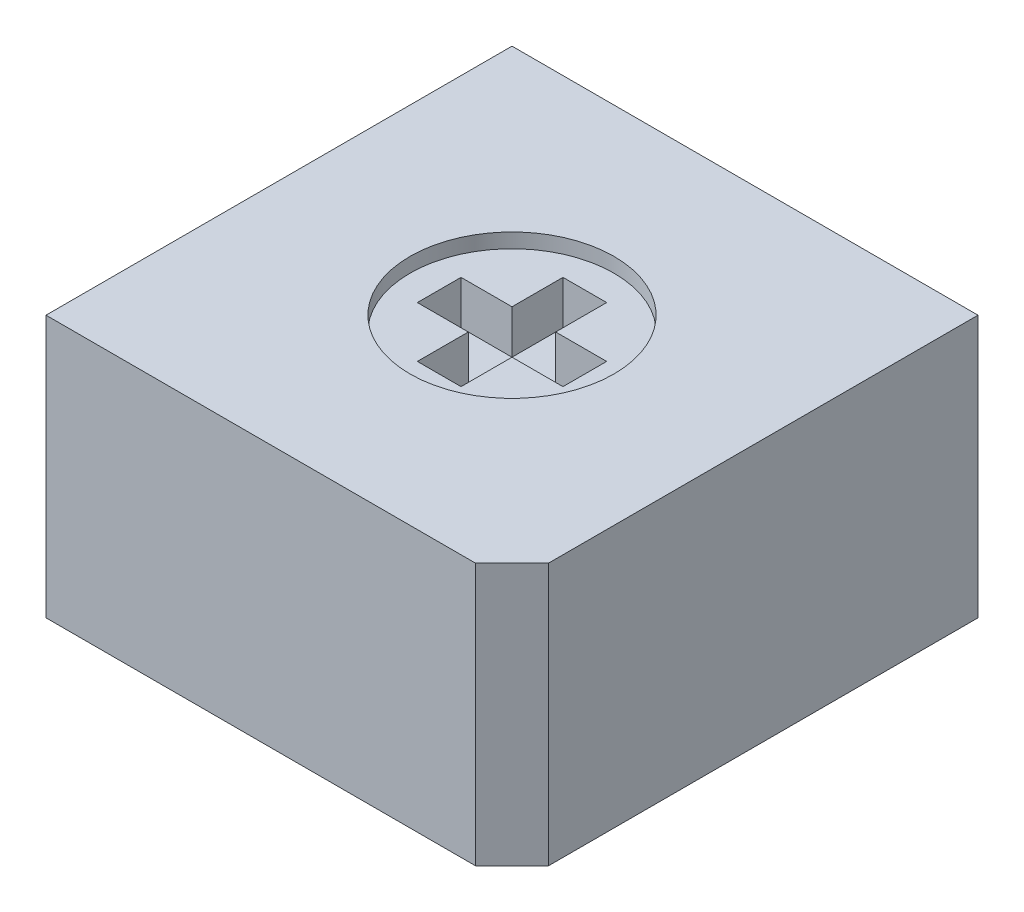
ISO-10303-21;
HEADER;
FILE_DESCRIPTION(('STEP AP214'),'2;1');
FILE_NAME('part.step','',(''),(''),'','','');
FILE_SCHEMA(('AUTOMOTIVE_DESIGN { 1 0 10303 214 1 1 1 1 }'));
ENDSEC;
DATA;
#1=APPLICATION_CONTEXT('core data for automotive mechanical design processes');
#2=APPLICATION_PROTOCOL_DEFINITION('international standard','automotive_design',2000,#1);
#3=PRODUCT_CONTEXT('',#1,'mechanical');
#4=PRODUCT('Part','Part','',(#3));
#5=PRODUCT_RELATED_PRODUCT_CATEGORY('part','',(#4));
#6=PRODUCT_DEFINITION_FORMATION('','',#4);
#7=PRODUCT_DEFINITION_CONTEXT('part definition',#1,'design');
#8=PRODUCT_DEFINITION('design','',#6,#7);
#9=PRODUCT_DEFINITION_SHAPE('','',#8);
#10=(LENGTH_UNIT() NAMED_UNIT(*) SI_UNIT(.MILLI.,.METRE.));
#11=(NAMED_UNIT(*) PLANE_ANGLE_UNIT() SI_UNIT($,.RADIAN.));
#12=(NAMED_UNIT(*) SI_UNIT($,.STERADIAN.) SOLID_ANGLE_UNIT());
#13=UNCERTAINTY_MEASURE_WITH_UNIT(LENGTH_MEASURE(1.E-05),#10,'distance_accuracy_value','');
#14=(GEOMETRIC_REPRESENTATION_CONTEXT(3) GLOBAL_UNCERTAINTY_ASSIGNED_CONTEXT((#13)) GLOBAL_UNIT_ASSIGNED_CONTEXT((#10,
#11,#12)) REPRESENTATION_CONTEXT('',''));
#15=CARTESIAN_POINT('',(0.,0.,0.));
#16=DIRECTION('',(0.,0.,1.));
#17=DIRECTION('',(1.,0.,0.));
#18=AXIS2_PLACEMENT_3D('',#15,#16,#17);
#19=CARTESIAN_POINT('',(27.9908,5.08,-13.2588));
#20=DIRECTION('',(0.,1.,0.));
#21=DIRECTION('',(-1.,0.,0.));
#22=AXIS2_PLACEMENT_3D('',#19,#20,#21);
#23=PLANE('',#22);
#24=DIRECTION('',(0.,0.,1.));
#25=VECTOR('',#24,1.);
#26=CARTESIAN_POINT('',(26.289,5.08,-11.1125));
#27=LINE('',#26,#25);
#28=CARTESIAN_POINT('',(26.289,5.08,-11.557));
#29=VERTEX_POINT('',#28);
#30=CARTESIAN_POINT('',(26.289,5.08,-10.668));
#31=VERTEX_POINT('',#30);
#32=EDGE_CURVE('E306',#29,#31,#27,.T.);
#33=ORIENTED_EDGE('',*,*,#32,.T.);
#34=DIRECTION('',(1.,0.,0.));
#35=VECTOR('',#34,1.);
#36=CARTESIAN_POINT('',(26.67,5.08,-10.668));
#37=LINE('',#36,#35);
#38=CARTESIAN_POINT('',(27.051,5.08,-10.668));
#39=VERTEX_POINT('',#38);
#40=EDGE_CURVE('E241',#31,#39,#37,.T.);
#41=ORIENTED_EDGE('',*,*,#40,.T.);
#42=DIRECTION('',(0.,0.,-1.));
#43=VECTOR('',#42,1.);
#44=CARTESIAN_POINT('',(27.051,5.08,-11.1125));
#45=LINE('',#44,#43);
#46=CARTESIAN_POINT('',(27.051,5.08,-11.557));
#47=VERTEX_POINT('',#46);
#48=EDGE_CURVE('E250',#39,#47,#45,.T.);
#49=ORIENTED_EDGE('',*,*,#48,.T.);
#50=DIRECTION('',(1.,0.,0.));
#51=VECTOR('',#50,1.);
#52=CARTESIAN_POINT('',(27.4955,5.08,-11.557));
#53=LINE('',#52,#51);
#54=CARTESIAN_POINT('',(27.94,5.08,-11.557));
#55=VERTEX_POINT('',#54);
#56=EDGE_CURVE('E256',#47,#55,#53,.T.);
#57=ORIENTED_EDGE('',*,*,#56,.T.);
#58=DIRECTION('',(0.,0.,-1.));
#59=VECTOR('',#58,1.);
#60=CARTESIAN_POINT('',(27.94,5.08,-11.938));
#61=LINE('',#60,#59);
#62=CARTESIAN_POINT('',(27.94,5.08,-12.319));
#63=VERTEX_POINT('',#62);
#64=EDGE_CURVE('E262',#55,#63,#61,.T.);
#65=ORIENTED_EDGE('',*,*,#64,.T.);
#66=DIRECTION('',(-1.,0.,0.));
#67=VECTOR('',#66,1.);
#68=CARTESIAN_POINT('',(27.4955,5.08,-12.319));
#69=LINE('',#68,#67);
#70=CARTESIAN_POINT('',(27.051,5.08,-12.319));
#71=VERTEX_POINT('',#70);
#72=EDGE_CURVE('E268',#63,#71,#69,.T.);
#73=ORIENTED_EDGE('',*,*,#72,.T.);
#74=DIRECTION('',(0.,0.,-1.));
#75=VECTOR('',#74,1.);
#76=CARTESIAN_POINT('',(27.051,5.08,-12.7635));
#77=LINE('',#76,#75);
#78=CARTESIAN_POINT('',(27.051,5.08,-13.208));
#79=VERTEX_POINT('',#78);
#80=EDGE_CURVE('E274',#71,#79,#77,.T.);
#81=ORIENTED_EDGE('',*,*,#80,.T.);
#82=DIRECTION('',(-1.,0.,0.));
#83=VECTOR('',#82,1.);
#84=CARTESIAN_POINT('',(26.67,5.08,-13.208));
#85=LINE('',#84,#83);
#86=CARTESIAN_POINT('',(26.289,5.08,-13.208));
#87=VERTEX_POINT('',#86);
#88=EDGE_CURVE('E280',#79,#87,#85,.T.);
#89=ORIENTED_EDGE('',*,*,#88,.T.);
#90=DIRECTION('',(0.,0.,1.));
#91=VECTOR('',#90,1.);
#92=CARTESIAN_POINT('',(26.289,5.08,-12.7635));
#93=LINE('',#92,#91);
#94=CARTESIAN_POINT('',(26.289,5.08,-12.319));
#95=VERTEX_POINT('',#94);
#96=EDGE_CURVE('E286',#87,#95,#93,.T.);
#97=ORIENTED_EDGE('',*,*,#96,.T.);
#98=DIRECTION('',(-1.,0.,0.));
#99=VECTOR('',#98,1.);
#100=CARTESIAN_POINT('',(25.8445,5.08,-12.319));
#101=LINE('',#100,#99);
#102=CARTESIAN_POINT('',(25.4,5.08,-12.319));
#103=VERTEX_POINT('',#102);
#104=EDGE_CURVE('E292',#95,#103,#101,.T.);
#105=ORIENTED_EDGE('',*,*,#104,.T.);
#106=DIRECTION('',(0.,0.,1.));
#107=VECTOR('',#106,1.);
#108=CARTESIAN_POINT('',(25.4,5.08,-11.938));
#109=LINE('',#108,#107);
#110=CARTESIAN_POINT('',(25.4,5.08,-11.557));
#111=VERTEX_POINT('',#110);
#112=EDGE_CURVE('E298',#103,#111,#109,.T.);
#113=ORIENTED_EDGE('',*,*,#112,.T.);
#114=DIRECTION('',(1.,0.,0.));
#115=VECTOR('',#114,1.);
#116=CARTESIAN_POINT('',(25.8445,5.08,-11.557));
#117=LINE('',#116,#115);
#118=EDGE_CURVE('E304',#111,#29,#117,.T.);
#119=ORIENTED_EDGE('',*,*,#118,.T.);
#120=EDGE_LOOP('',(#33,#41,#49,#57,#65,#73,#81,#89,#97,#105,#113,#119));
#121=FACE_BOUND('',#120,.T.);
#122=ADVANCED_FACE('F17',(#121),#23,.T.);
#123=CARTESIAN_POINT('',(26.289,5.06476,-11.57478));
#124=DIRECTION('',(-1.,0.,0.));
#125=DIRECTION('',(0.,0.,1.));
#126=AXIS2_PLACEMENT_3D('',#123,#124,#125);
#127=PLANE('',#126);
#128=ORIENTED_EDGE('',*,*,#32,.F.);
#129=DIRECTION('',(0.,1.,0.));
#130=VECTOR('',#129,1.);
#131=CARTESIAN_POINT('',(26.289,5.461,-11.557));
#132=LINE('',#131,#130);
#133=CARTESIAN_POINT('',(26.289,5.842,-11.557));
#134=VERTEX_POINT('',#133);
#135=EDGE_CURVE('E301',#29,#134,#132,.T.);
#136=ORIENTED_EDGE('',*,*,#135,.T.);
#137=DIRECTION('',(0.,0.,-1.));
#138=VECTOR('',#137,1.);
#139=CARTESIAN_POINT('',(26.289,5.842,-11.938));
#140=LINE('',#139,#138);
#141=CARTESIAN_POINT('',(26.289,5.842,-10.668));
#142=VERTEX_POINT('',#141);
#143=EDGE_CURVE('E236',#142,#134,#140,.T.);
#144=ORIENTED_EDGE('',*,*,#143,.F.);
#145=DIRECTION('',(0.,-1.,0.));
#146=VECTOR('',#145,1.);
#147=CARTESIAN_POINT('',(26.289,5.461,-10.668));
#148=LINE('',#147,#146);
#149=EDGE_CURVE('E244',#142,#31,#148,.T.);
#150=ORIENTED_EDGE('',*,*,#149,.T.);
#151=EDGE_LOOP('',(#128,#136,#144,#150));
#152=FACE_BOUND('',#151,.T.);
#153=ADVANCED_FACE('F315',(#152),#127,.F.);
#154=CARTESIAN_POINT('',(25.38222,5.06476,-11.557));
#155=DIRECTION('',(0.,0.,1.));
#156=DIRECTION('',(1.,0.,0.));
#157=AXIS2_PLACEMENT_3D('',#154,#155,#156);
#158=PLANE('',#157);
#159=ORIENTED_EDGE('',*,*,#118,.F.);
#160=DIRECTION('',(0.,1.,0.));
#161=VECTOR('',#160,1.);
#162=CARTESIAN_POINT('',(25.4,5.461,-11.557));
#163=LINE('',#162,#161);
#164=CARTESIAN_POINT('',(25.4,5.842,-11.557));
#165=VERTEX_POINT('',#164);
#166=EDGE_CURVE('E295',#111,#165,#163,.T.);
#167=ORIENTED_EDGE('',*,*,#166,.T.);
#168=DIRECTION('',(-1.,0.,0.));
#169=VECTOR('',#168,1.);
#170=CARTESIAN_POINT('',(26.67,5.842,-11.557));
#171=LINE('',#170,#169);
#172=EDGE_CURVE('E234',#134,#165,#171,.T.);
#173=ORIENTED_EDGE('',*,*,#172,.F.);
#174=ORIENTED_EDGE('',*,*,#135,.F.);
#175=EDGE_LOOP('',(#159,#167,#173,#174));
#176=FACE_BOUND('',#175,.T.);
#177=ADVANCED_FACE('F355',(#176),#158,.F.);
#178=CARTESIAN_POINT('',(25.4,5.06476,-12.33424));
#179=DIRECTION('',(-1.,0.,0.));
#180=DIRECTION('',(0.,0.,1.));
#181=AXIS2_PLACEMENT_3D('',#178,#179,#180);
#182=PLANE('',#181);
#183=ORIENTED_EDGE('',*,*,#112,.F.);
#184=DIRECTION('',(0.,1.,0.));
#185=VECTOR('',#184,1.);
#186=CARTESIAN_POINT('',(25.4,5.461,-12.319));
#187=LINE('',#186,#185);
#188=CARTESIAN_POINT('',(25.4,5.842,-12.319));
#189=VERTEX_POINT('',#188);
#190=EDGE_CURVE('E289',#103,#189,#187,.T.);
#191=ORIENTED_EDGE('',*,*,#190,.T.);
#192=DIRECTION('',(0.,0.,-1.));
#193=VECTOR('',#192,1.);
#194=CARTESIAN_POINT('',(25.4,5.842,-11.938));
#195=LINE('',#194,#193);
#196=EDGE_CURVE('E232',#165,#189,#195,.T.);
#197=ORIENTED_EDGE('',*,*,#196,.F.);
#198=ORIENTED_EDGE('',*,*,#166,.F.);
#199=EDGE_LOOP('',(#183,#191,#197,#198));
#200=FACE_BOUND('',#199,.T.);
#201=ADVANCED_FACE('F352',(#200),#182,.F.);
#202=CARTESIAN_POINT('',(26.30678,5.06476,-12.319));
#203=DIRECTION('',(0.,0.,-1.));
#204=DIRECTION('',(-1.,0.,0.));
#205=AXIS2_PLACEMENT_3D('',#202,#203,#204);
#206=PLANE('',#205);
#207=ORIENTED_EDGE('',*,*,#104,.F.);
#208=DIRECTION('',(0.,1.,0.));
#209=VECTOR('',#208,1.);
#210=CARTESIAN_POINT('',(26.289,5.461,-12.319));
#211=LINE('',#210,#209);
#212=CARTESIAN_POINT('',(26.289,5.842,-12.319));
#213=VERTEX_POINT('',#212);
#214=EDGE_CURVE('E283',#95,#213,#211,.T.);
#215=ORIENTED_EDGE('',*,*,#214,.T.);
#216=DIRECTION('',(1.,0.,0.));
#217=VECTOR('',#216,1.);
#218=CARTESIAN_POINT('',(26.67,5.842,-12.319));
#219=LINE('',#218,#217);
#220=EDGE_CURVE('E230',#189,#213,#219,.T.);
#221=ORIENTED_EDGE('',*,*,#220,.F.);
#222=ORIENTED_EDGE('',*,*,#190,.F.);
#223=EDGE_LOOP('',(#207,#215,#221,#222));
#224=FACE_BOUND('',#223,.T.);
#225=ADVANCED_FACE('F348',(#224),#206,.F.);
#226=CARTESIAN_POINT('',(26.289,5.06476,-13.22578));
#227=DIRECTION('',(-1.,0.,0.));
#228=DIRECTION('',(0.,0.,1.));
#229=AXIS2_PLACEMENT_3D('',#226,#227,#228);
#230=PLANE('',#229);
#231=ORIENTED_EDGE('',*,*,#96,.F.);
#232=DIRECTION('',(0.,1.,0.));
#233=VECTOR('',#232,1.);
#234=CARTESIAN_POINT('',(26.289,5.461,-13.208));
#235=LINE('',#234,#233);
#236=CARTESIAN_POINT('',(26.289,5.842,-13.208));
#237=VERTEX_POINT('',#236);
#238=EDGE_CURVE('E277',#87,#237,#235,.T.);
#239=ORIENTED_EDGE('',*,*,#238,.T.);
#240=DIRECTION('',(0.,0.,-1.));
#241=VECTOR('',#240,1.);
#242=CARTESIAN_POINT('',(26.289,5.842,-11.938));
#243=LINE('',#242,#241);
#244=EDGE_CURVE('E228',#213,#237,#243,.T.);
#245=ORIENTED_EDGE('',*,*,#244,.F.);
#246=ORIENTED_EDGE('',*,*,#214,.F.);
#247=EDGE_LOOP('',(#231,#239,#245,#246));
#248=FACE_BOUND('',#247,.T.);
#249=ADVANCED_FACE('F344',(#248),#230,.F.);
#250=CARTESIAN_POINT('',(27.06624,5.06476,-13.208));
#251=DIRECTION('',(0.,0.,-1.));
#252=DIRECTION('',(-1.,0.,0.));
#253=AXIS2_PLACEMENT_3D('',#250,#251,#252);
#254=PLANE('',#253);
#255=ORIENTED_EDGE('',*,*,#88,.F.);
#256=DIRECTION('',(0.,1.,0.));
#257=VECTOR('',#256,1.);
#258=CARTESIAN_POINT('',(27.051,5.461,-13.208));
#259=LINE('',#258,#257);
#260=CARTESIAN_POINT('',(27.051,5.842,-13.208));
#261=VERTEX_POINT('',#260);
#262=EDGE_CURVE('E271',#79,#261,#259,.T.);
#263=ORIENTED_EDGE('',*,*,#262,.T.);
#264=DIRECTION('',(1.,0.,0.));
#265=VECTOR('',#264,1.);
#266=CARTESIAN_POINT('',(26.67,5.842,-13.208));
#267=LINE('',#266,#265);
#268=EDGE_CURVE('E226',#237,#261,#267,.T.);
#269=ORIENTED_EDGE('',*,*,#268,.F.);
#270=ORIENTED_EDGE('',*,*,#238,.F.);
#271=EDGE_LOOP('',(#255,#263,#269,#270));
#272=FACE_BOUND('',#271,.T.);
#273=ADVANCED_FACE('F340',(#272),#254,.F.);
#274=CARTESIAN_POINT('',(27.051,5.06476,-12.30122));
#275=DIRECTION('',(1.,0.,0.));
#276=DIRECTION('',(0.,0.,-1.));
#277=AXIS2_PLACEMENT_3D('',#274,#275,#276);
#278=PLANE('',#277);
#279=ORIENTED_EDGE('',*,*,#80,.F.);
#280=DIRECTION('',(0.,1.,0.));
#281=VECTOR('',#280,1.);
#282=CARTESIAN_POINT('',(27.051,5.461,-12.319));
#283=LINE('',#282,#281);
#284=CARTESIAN_POINT('',(27.051,5.842,-12.319));
#285=VERTEX_POINT('',#284);
#286=EDGE_CURVE('E265',#71,#285,#283,.T.);
#287=ORIENTED_EDGE('',*,*,#286,.T.);
#288=DIRECTION('',(0.,0.,1.));
#289=VECTOR('',#288,1.);
#290=CARTESIAN_POINT('',(27.051,5.842,-11.938));
#291=LINE('',#290,#289);
#292=EDGE_CURVE('E224',#261,#285,#291,.T.);
#293=ORIENTED_EDGE('',*,*,#292,.F.);
#294=ORIENTED_EDGE('',*,*,#262,.F.);
#295=EDGE_LOOP('',(#279,#287,#293,#294));
#296=FACE_BOUND('',#295,.T.);
#297=ADVANCED_FACE('F336',(#296),#278,.F.);
#298=CARTESIAN_POINT('',(27.95778,5.06476,-12.319));
#299=DIRECTION('',(0.,0.,-1.));
#300=DIRECTION('',(-1.,0.,0.));
#301=AXIS2_PLACEMENT_3D('',#298,#299,#300);
#302=PLANE('',#301);
#303=ORIENTED_EDGE('',*,*,#72,.F.);
#304=DIRECTION('',(0.,1.,0.));
#305=VECTOR('',#304,1.);
#306=CARTESIAN_POINT('',(27.94,5.461,-12.319));
#307=LINE('',#306,#305);
#308=CARTESIAN_POINT('',(27.94,5.842,-12.319));
#309=VERTEX_POINT('',#308);
#310=EDGE_CURVE('E259',#63,#309,#307,.T.);
#311=ORIENTED_EDGE('',*,*,#310,.T.);
#312=DIRECTION('',(1.,0.,0.));
#313=VECTOR('',#312,1.);
#314=CARTESIAN_POINT('',(26.67,5.842,-12.319));
#315=LINE('',#314,#313);
#316=EDGE_CURVE('E222',#285,#309,#315,.T.);
#317=ORIENTED_EDGE('',*,*,#316,.F.);
#318=ORIENTED_EDGE('',*,*,#286,.F.);
#319=EDGE_LOOP('',(#303,#311,#317,#318));
#320=FACE_BOUND('',#319,.T.);
#321=ADVANCED_FACE('F332',(#320),#302,.F.);
#322=CARTESIAN_POINT('',(27.94,5.06476,-11.54176));
#323=DIRECTION('',(1.,0.,0.));
#324=DIRECTION('',(0.,0.,-1.));
#325=AXIS2_PLACEMENT_3D('',#322,#323,#324);
#326=PLANE('',#325);
#327=ORIENTED_EDGE('',*,*,#64,.F.);
#328=DIRECTION('',(0.,1.,0.));
#329=VECTOR('',#328,1.);
#330=CARTESIAN_POINT('',(27.94,5.461,-11.557));
#331=LINE('',#330,#329);
#332=CARTESIAN_POINT('',(27.94,5.842,-11.557));
#333=VERTEX_POINT('',#332);
#334=EDGE_CURVE('E253',#55,#333,#331,.T.);
#335=ORIENTED_EDGE('',*,*,#334,.T.);
#336=DIRECTION('',(0.,0.,1.));
#337=VECTOR('',#336,1.);
#338=CARTESIAN_POINT('',(27.94,5.842,-11.938));
#339=LINE('',#338,#337);
#340=EDGE_CURVE('E220',#309,#333,#339,.T.);
#341=ORIENTED_EDGE('',*,*,#340,.F.);
#342=ORIENTED_EDGE('',*,*,#310,.F.);
#343=EDGE_LOOP('',(#327,#335,#341,#342));
#344=FACE_BOUND('',#343,.T.);
#345=ADVANCED_FACE('F328',(#344),#326,.F.);
#346=CARTESIAN_POINT('',(27.03322,5.06476,-11.557));
#347=DIRECTION('',(0.,0.,1.));
#348=DIRECTION('',(1.,0.,0.));
#349=AXIS2_PLACEMENT_3D('',#346,#347,#348);
#350=PLANE('',#349);
#351=ORIENTED_EDGE('',*,*,#56,.F.);
#352=DIRECTION('',(0.,1.,0.));
#353=VECTOR('',#352,1.);
#354=CARTESIAN_POINT('',(27.051,5.461,-11.557));
#355=LINE('',#354,#353);
#356=CARTESIAN_POINT('',(27.051,5.842,-11.557));
#357=VERTEX_POINT('',#356);
#358=EDGE_CURVE('E247',#47,#357,#355,.T.);
#359=ORIENTED_EDGE('',*,*,#358,.T.);
#360=DIRECTION('',(-1.,0.,0.));
#361=VECTOR('',#360,1.);
#362=CARTESIAN_POINT('',(26.67,5.842,-11.557));
#363=LINE('',#362,#361);
#364=EDGE_CURVE('E218',#333,#357,#363,.T.);
#365=ORIENTED_EDGE('',*,*,#364,.F.);
#366=ORIENTED_EDGE('',*,*,#334,.F.);
#367=EDGE_LOOP('',(#351,#359,#365,#366));
#368=FACE_BOUND('',#367,.T.);
#369=ADVANCED_FACE('F325',(#368),#350,.F.);
#370=CARTESIAN_POINT('',(27.051,5.06476,-10.65022));
#371=DIRECTION('',(1.,0.,0.));
#372=DIRECTION('',(0.,0.,-1.));
#373=AXIS2_PLACEMENT_3D('',#370,#371,#372);
#374=PLANE('',#373);
#375=ORIENTED_EDGE('',*,*,#48,.F.);
#376=DIRECTION('',(0.,1.,0.));
#377=VECTOR('',#376,1.);
#378=CARTESIAN_POINT('',(27.051,5.461,-10.668));
#379=LINE('',#378,#377);
#380=CARTESIAN_POINT('',(27.051,5.842,-10.668));
#381=VERTEX_POINT('',#380);
#382=EDGE_CURVE('E238',#39,#381,#379,.T.);
#383=ORIENTED_EDGE('',*,*,#382,.T.);
#384=DIRECTION('',(0.,0.,1.));
#385=VECTOR('',#384,1.);
#386=CARTESIAN_POINT('',(27.051,5.842,-11.938));
#387=LINE('',#386,#385);
#388=EDGE_CURVE('E216',#357,#381,#387,.T.);
#389=ORIENTED_EDGE('',*,*,#388,.F.);
#390=ORIENTED_EDGE('',*,*,#358,.F.);
#391=EDGE_LOOP('',(#375,#383,#389,#390));
#392=FACE_BOUND('',#391,.T.);
#393=ADVANCED_FACE('F322',(#392),#374,.F.);
#394=CARTESIAN_POINT('',(26.27376,5.06476,-10.668));
#395=DIRECTION('',(0.,0.,1.));
#396=DIRECTION('',(1.,0.,0.));
#397=AXIS2_PLACEMENT_3D('',#394,#395,#396);
#398=PLANE('',#397);
#399=ORIENTED_EDGE('',*,*,#40,.F.);
#400=ORIENTED_EDGE('',*,*,#149,.F.);
#401=DIRECTION('',(-1.,0.,0.));
#402=VECTOR('',#401,1.);
#403=CARTESIAN_POINT('',(26.67,5.842,-10.668));
#404=LINE('',#403,#402);
#405=EDGE_CURVE('E213',#381,#142,#404,.T.);
#406=ORIENTED_EDGE('',*,*,#405,.F.);
#407=ORIENTED_EDGE('',*,*,#382,.F.);
#408=EDGE_LOOP('',(#399,#400,#406,#407));
#409=FACE_BOUND('',#408,.T.);
#410=ADVANCED_FACE('F179',(#409),#398,.F.);
#411=CARTESIAN_POINT('',(28.51912,5.842,-13.78712));
#412=DIRECTION('',(0.,1.,0.));
#413=DIRECTION('',(-1.,0.,0.));
#414=AXIS2_PLACEMENT_3D('',#411,#412,#413);
#415=PLANE('',#414);
#416=ORIENTED_EDGE('',*,*,#388,.T.);
#417=ORIENTED_EDGE('',*,*,#405,.T.);
#418=ORIENTED_EDGE('',*,*,#143,.T.);
#419=ORIENTED_EDGE('',*,*,#172,.T.);
#420=ORIENTED_EDGE('',*,*,#196,.T.);
#421=ORIENTED_EDGE('',*,*,#220,.T.);
#422=ORIENTED_EDGE('',*,*,#244,.T.);
#423=ORIENTED_EDGE('',*,*,#268,.T.);
#424=ORIENTED_EDGE('',*,*,#292,.T.);
#425=ORIENTED_EDGE('',*,*,#316,.T.);
#426=ORIENTED_EDGE('',*,*,#340,.T.);
#427=ORIENTED_EDGE('',*,*,#364,.T.);
#428=EDGE_LOOP('',(#416,#417,#418,#419,#420,#421,#422,#423,#424,#425,#426,#427));
#429=FACE_BOUND('',#428,.T.);
#430=CARTESIAN_POINT('',(26.67,5.84199999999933,-11.938));
#431=DIRECTION('',(0.,1.,0.));
#432=DIRECTION('',(0.,0.,1.));
#433=AXIS2_PLACEMENT_3D('',#430,#431,#432);
#434=CIRCLE('',#433,1.778);
#435=CARTESIAN_POINT('',(26.67,5.84199999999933,-10.16));
#436=VERTEX_POINT('',#435);
#437=EDGE_CURVE('E21',#436,#436,#434,.F.);
#438=ORIENTED_EDGE('',*,*,#437,.F.);
#439=EDGE_LOOP('',(#438));
#440=FACE_BOUND('',#439,.T.);
#441=ADVANCED_FACE('F169',(#429,#440),#415,.T.);
#442=CARTESIAN_POINT('',(26.67,5.84199999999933,-11.938));
#443=DIRECTION('',(0.,1.,0.));
#444=DIRECTION('',(0.,0.,1.));
#445=AXIS2_PLACEMENT_3D('',#442,#443,#444);
#446=CYLINDRICAL_SURFACE('',#445,1.778);
#447=ORIENTED_EDGE('',*,*,#437,.T.);
#448=EDGE_LOOP('',(#447));
#449=FACE_BOUND('',#448,.T.);
#450=CARTESIAN_POINT('',(26.67,6.09600000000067,-11.938));
#451=DIRECTION('',(0.,1.,0.));
#452=DIRECTION('',(0.,0.,1.));
#453=AXIS2_PLACEMENT_3D('',#450,#451,#452);
#454=CIRCLE('',#453,1.778);
#455=CARTESIAN_POINT('',(26.67,6.09600000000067,-10.16));
#456=VERTEX_POINT('',#455);
#457=EDGE_CURVE('E149',#456,#456,#454,.F.);
#458=ORIENTED_EDGE('',*,*,#457,.F.);
#459=EDGE_LOOP('',(#458));
#460=FACE_BOUND('',#459,.T.);
#461=ADVANCED_FACE('F167',(#449,#460),#446,.F.);
#462=CARTESIAN_POINT('',(30.7467,6.18744,-8.5217));
#463=DIRECTION('',(0.70710678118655,0.,0.707106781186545));
#464=DIRECTION('',(-0.707106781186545,0.,0.70710678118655));
#465=AXIS2_PLACEMENT_3D('',#462,#463,#464);
#466=PLANE('',#465);
#467=DIRECTION('',(0.707106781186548,0.,-0.707106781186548));
#468=VECTOR('',#467,1.);
#469=CARTESIAN_POINT('',(30.099,6.096,-7.874));
#470=LINE('',#469,#468);
#471=CARTESIAN_POINT('',(30.099,6.096,-7.874));
#472=VERTEX_POINT('',#471);
#473=CARTESIAN_POINT('',(30.734,6.096,-8.509));
#474=VERTEX_POINT('',#473);
#475=EDGE_CURVE('E142',#472,#474,#470,.T.);
#476=ORIENTED_EDGE('',*,*,#475,.F.);
#477=DIRECTION('',(0.,1.,0.));
#478=VECTOR('',#477,1.);
#479=CARTESIAN_POINT('',(30.099,3.81,-7.874));
#480=LINE('',#479,#478);
#481=CARTESIAN_POINT('',(30.099,1.524,-7.87400000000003));
#482=VERTEX_POINT('',#481);
#483=EDGE_CURVE('E131',#482,#472,#480,.T.);
#484=ORIENTED_EDGE('',*,*,#483,.F.);
#485=DIRECTION('',(0.707106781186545,0.,-0.70710678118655));
#486=VECTOR('',#485,1.);
#487=CARTESIAN_POINT('',(30.4165,1.524,-8.1915));
#488=LINE('',#487,#486);
#489=CARTESIAN_POINT('',(30.734,1.524,-8.50899999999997));
#490=VERTEX_POINT('',#489);
#491=EDGE_CURVE('E150',#482,#490,#488,.T.);
#492=ORIENTED_EDGE('',*,*,#491,.T.);
#493=DIRECTION('',(0.,-1.,0.));
#494=VECTOR('',#493,1.);
#495=CARTESIAN_POINT('',(30.734,3.81,-8.509));
#496=LINE('',#495,#494);
#497=EDGE_CURVE('E145',#474,#490,#496,.T.);
#498=ORIENTED_EDGE('',*,*,#497,.F.);
#499=EDGE_LOOP('',(#476,#484,#492,#498));
#500=FACE_BOUND('',#499,.T.);
#501=ADVANCED_FACE('F143',(#500),#466,.T.);
#502=CARTESIAN_POINT('',(30.89656,6.096,-16.16456));
#503=DIRECTION('',(0.,1.,0.));
#504=DIRECTION('',(-1.,0.,0.));
#505=AXIS2_PLACEMENT_3D('',#502,#503,#504);
#506=PLANE('',#505);
#507=ORIENTED_EDGE('',*,*,#457,.T.);
#508=EDGE_LOOP('',(#507));
#509=FACE_BOUND('',#508,.T.);
#510=DIRECTION('',(0.,0.,-1.));
#511=VECTOR('',#510,1.);
#512=CARTESIAN_POINT('',(22.606,6.096,-11.938));
#513=LINE('',#512,#511);
#514=CARTESIAN_POINT('',(22.606,6.096,-7.874));
#515=VERTEX_POINT('',#514);
#516=CARTESIAN_POINT('',(22.606,6.096,-16.002));
#517=VERTEX_POINT('',#516);
#518=EDGE_CURVE('E153',#515,#517,#513,.T.);
#519=ORIENTED_EDGE('',*,*,#518,.F.);
#520=DIRECTION('',(-1.,0.,0.));
#521=VECTOR('',#520,1.);
#522=CARTESIAN_POINT('',(26.3525,6.096,-7.874));
#523=LINE('',#522,#521);
#524=EDGE_CURVE('E135',#472,#515,#523,.T.);
#525=ORIENTED_EDGE('',*,*,#524,.F.);
#526=ORIENTED_EDGE('',*,*,#475,.T.);
#527=DIRECTION('',(0.,0.,1.));
#528=VECTOR('',#527,1.);
#529=CARTESIAN_POINT('',(30.734,6.096,-12.2555));
#530=LINE('',#529,#528);
#531=CARTESIAN_POINT('',(30.734,6.096,-16.002));
#532=VERTEX_POINT('',#531);
#533=EDGE_CURVE('E159',#532,#474,#530,.T.);
#534=ORIENTED_EDGE('',*,*,#533,.F.);
#535=DIRECTION('',(1.,0.,0.));
#536=VECTOR('',#535,1.);
#537=CARTESIAN_POINT('',(26.67,6.096,-16.002));
#538=LINE('',#537,#536);
#539=EDGE_CURVE('E161',#517,#532,#538,.T.);
#540=ORIENTED_EDGE('',*,*,#539,.F.);
#541=EDGE_LOOP('',(#519,#525,#526,#534,#540));
#542=FACE_BOUND('',#541,.T.);
#543=ADVANCED_FACE('F151',(#509,#542),#506,.T.);
#544=CARTESIAN_POINT('',(30.734,1.43256,-8.35914));
#545=DIRECTION('',(1.,0.,0.));
#546=DIRECTION('',(0.,0.,-1.));
#547=AXIS2_PLACEMENT_3D('',#544,#545,#546);
#548=PLANE('',#547);
#549=DIRECTION('',(0.,-1.,0.));
#550=VECTOR('',#549,1.);
#551=CARTESIAN_POINT('',(30.734,3.81,-16.002));
#552=LINE('',#551,#550);
#553=CARTESIAN_POINT('',(30.734,1.524,-16.002));
#554=VERTEX_POINT('',#553);
#555=EDGE_CURVE('E204',#532,#554,#552,.T.);
#556=ORIENTED_EDGE('',*,*,#555,.F.);
#557=ORIENTED_EDGE('',*,*,#533,.T.);
#558=ORIENTED_EDGE('',*,*,#497,.T.);
#559=DIRECTION('',(0.,0.,-1.));
#560=VECTOR('',#559,1.);
#561=CARTESIAN_POINT('',(30.734,1.524,-11.938));
#562=LINE('',#561,#560);
#563=EDGE_CURVE('E155',#490,#554,#562,.T.);
#564=ORIENTED_EDGE('',*,*,#563,.T.);
#565=EDGE_LOOP('',(#556,#557,#558,#564));
#566=FACE_BOUND('',#565,.T.);
#567=ADVANCED_FACE('F385',(#566),#548,.T.);
#568=CARTESIAN_POINT('',(30.89656,1.43256,-16.002));
#569=DIRECTION('',(0.,0.,-1.));
#570=DIRECTION('',(-1.,0.,0.));
#571=AXIS2_PLACEMENT_3D('',#568,#569,#570);
#572=PLANE('',#571);
#573=ORIENTED_EDGE('',*,*,#539,.T.);
#574=ORIENTED_EDGE('',*,*,#555,.T.);
#575=DIRECTION('',(-1.,0.,0.));
#576=VECTOR('',#575,1.);
#577=CARTESIAN_POINT('',(26.67,1.524,-16.002));
#578=LINE('',#577,#576);
#579=CARTESIAN_POINT('',(22.606,1.524,-16.002));
#580=VERTEX_POINT('',#579);
#581=EDGE_CURVE('E196',#554,#580,#578,.T.);
#582=ORIENTED_EDGE('',*,*,#581,.T.);
#583=DIRECTION('',(0.,-1.,0.));
#584=VECTOR('',#583,1.);
#585=CARTESIAN_POINT('',(22.606,3.81,-16.002));
#586=LINE('',#585,#584);
#587=EDGE_CURVE('E138',#517,#580,#586,.T.);
#588=ORIENTED_EDGE('',*,*,#587,.F.);
#589=EDGE_LOOP('',(#573,#574,#582,#588));
#590=FACE_BOUND('',#589,.T.);
#591=ADVANCED_FACE('F202',(#590),#572,.T.);
#592=CARTESIAN_POINT('',(22.606,1.43256,-16.16456));
#593=DIRECTION('',(-1.,0.,0.));
#594=DIRECTION('',(0.,0.,1.));
#595=AXIS2_PLACEMENT_3D('',#592,#593,#594);
#596=PLANE('',#595);
#597=ORIENTED_EDGE('',*,*,#518,.T.);
#598=ORIENTED_EDGE('',*,*,#587,.T.);
#599=DIRECTION('',(0.,0.,1.));
#600=VECTOR('',#599,1.);
#601=CARTESIAN_POINT('',(22.606,1.524,-11.938));
#602=LINE('',#601,#600);
#603=CARTESIAN_POINT('',(22.606,1.524,-7.874));
#604=VERTEX_POINT('',#603);
#605=EDGE_CURVE('E27',#580,#604,#602,.T.);
#606=ORIENTED_EDGE('',*,*,#605,.T.);
#607=DIRECTION('',(0.,-1.,0.));
#608=VECTOR('',#607,1.);
#609=CARTESIAN_POINT('',(22.606,3.81,-7.874));
#610=LINE('',#609,#608);
#611=EDGE_CURVE('E35',#515,#604,#610,.T.);
#612=ORIENTED_EDGE('',*,*,#611,.F.);
#613=EDGE_LOOP('',(#597,#598,#606,#612));
#614=FACE_BOUND('',#613,.T.);
#615=ADVANCED_FACE('F190',(#614),#596,.T.);
#616=CARTESIAN_POINT('',(22.45614,1.43256,-7.874));
#617=DIRECTION('',(0.,0.,1.));
#618=DIRECTION('',(1.,0.,0.));
#619=AXIS2_PLACEMENT_3D('',#616,#617,#618);
#620=PLANE('',#619);
#621=ORIENTED_EDGE('',*,*,#611,.T.);
#622=DIRECTION('',(1.,0.,0.));
#623=VECTOR('',#622,1.);
#624=CARTESIAN_POINT('',(26.67,1.524,-7.874));
#625=LINE('',#624,#623);
#626=EDGE_CURVE('E11',#604,#482,#625,.T.);
#627=ORIENTED_EDGE('',*,*,#626,.T.);
#628=ORIENTED_EDGE('',*,*,#483,.T.);
#629=ORIENTED_EDGE('',*,*,#524,.T.);
#630=EDGE_LOOP('',(#621,#627,#628,#629));
#631=FACE_BOUND('',#630,.T.);
#632=ADVANCED_FACE('F133',(#631),#620,.T.);
#633=CARTESIAN_POINT('',(30.89656,1.524,-16.16456));
#634=DIRECTION('',(0.,1.,0.));
#635=DIRECTION('',(-1.,0.,0.));
#636=AXIS2_PLACEMENT_3D('',#633,#634,#635);
#637=PLANE('',#636);
#638=ORIENTED_EDGE('',*,*,#605,.F.);
#639=ORIENTED_EDGE('',*,*,#581,.F.);
#640=ORIENTED_EDGE('',*,*,#563,.F.);
#641=ORIENTED_EDGE('',*,*,#491,.F.);
#642=ORIENTED_EDGE('',*,*,#626,.F.);
#643=EDGE_LOOP('',(#638,#639,#640,#641,#642));
#644=FACE_BOUND('',#643,.T.);
#645=ADVANCED_FACE('F19',(#644),#637,.F.);
#646=CLOSED_SHELL('',(#122,#153,#177,#201,#225,#249,#273,#297,#321,#345,#369,#393,#410,#441,
#461,#501,#543,#567,#591,#615,#632,#645));
#647=MANIFOLD_SOLID_BREP('B1',#646);
#648=ADVANCED_BREP_SHAPE_REPRESENTATION('',(#18,#647),#14);
#649=SHAPE_DEFINITION_REPRESENTATION(#9,#648);
ENDSEC;
END-ISO-10303-21;
